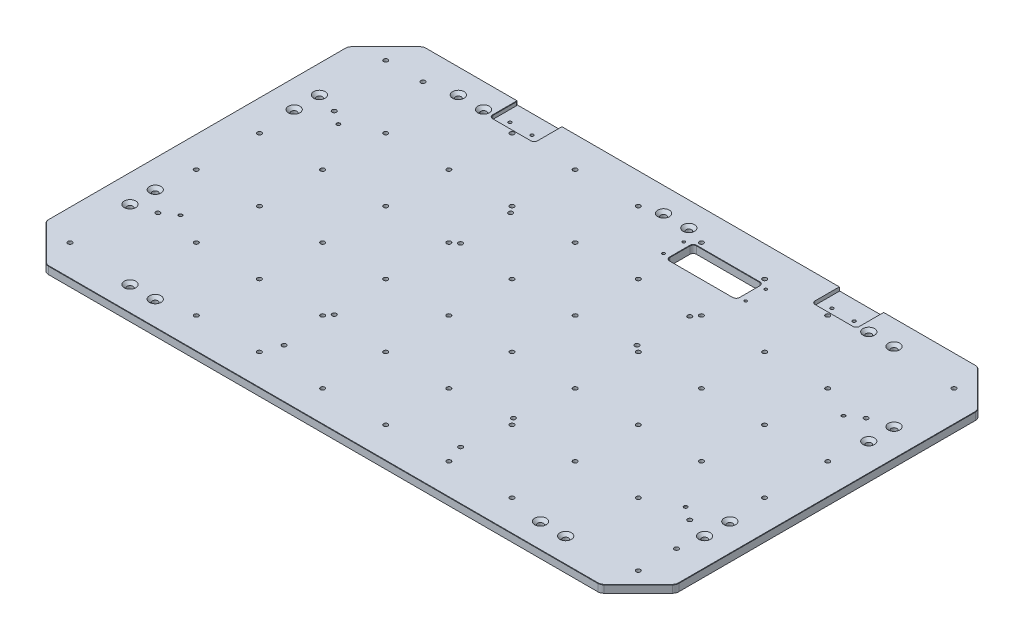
from build123d import *

# Parameters (mm, degrees)
AUFSATZ_LINEAR_AUSTRAGEN1_DEPTH                      = 12
VERRUNDUNG1_R                                        = 10
M8_GEWINDEBOHRUNG1_D                                 = 6.8
M8_GEWINDEBOHRUNG2_D                                 = 6.8
M8_GEWINDEBOHRUNG3_D                                 = 6.8
LINEARES_MUSTER1_COUNT                               = 10
LINEARES_MUSTER1_PITCH                               = 100
LINEARES_MUSTER1_COUNT_DIR2                          = 6
LINEARES_MUSTER1_PITCH_DIR2                          = 100
SCHNITT_LINEAR_AUSTRAGEN1_DEPTH                      = 582.847058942
M5_GEWINDEBOHRUNG1_D                                 = 4.2
M5_GEWINDEBOHRUNG1_DEPTH                             = 12
M5_GEWINDEBOHRUNG1_TIP                               = 1.2618073
SCHNITT_LINEAR_AUSTRAGEN2_DEPTH                      = 6
VERRUNDUNG2_R                                        = 2
M6_GEWINDEBOHRUNG1_D                                 = 5
F_5_0MM_STIFTLOCH1_D                                 = 5
F_5_0MM_STIFTLOCH1_DEPTH                             = 8
F_5_0MM_STIFTLOCH1_CSINK_D                           = 5.5
F_5_0MM_STIFTLOCH1_CSINK_ANGLE                       = 90
F_5_0MM_STIFTLOCH1_TIP                               = 1.502151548
FASE1_SIZE                                           = 0.5
FASE2_SIZE                                           = 0.5
SKIZZE22_R                                           = 5
AUFSATZ_LINEAR_AUSTRAGEN2_DEPTH                      = 12
FORMSENKUNG_F_R_M8_SENKSCHRAUBE_MIT_INNE_D           = 9
FORMSENKUNG_F_R_M8_SENKSCHRAUBE_MIT_INNE_CSINK_D     = 18.25
FORMSENKUNG_F_R_M8_SENKSCHRAUBE_MIT_INNE_CSINK_ANGLE = 90
M8_GEWINDEBOHRUNG4_D                                 = 6.8


with BuildPart() as part:
    # Skizze1 → Aufsatz-Linear austragen1 (new body)
    with BuildSketch(Plane(origin=(0, 0, 0), x_dir=(1, 0, 0), z_dir=(0, 1, 0))):
        Polygon((-439, 299), (-499, 239), (-499, -239), (-439, -299), (439, -299), (499, -239), (499, 239), (439, 299), align=None)
    extrude(amount=AUFSATZ_LINEAR_AUSTRAGEN1_DEPTH)

    # Verrundung1
    verrundung1_edges = [part.edges().sort_by_distance(p)[0] for p in [
        (499, 6, -239),
        (499, 6, 239),
        (439, 6, 299),
        (-439, 6, 299),
        (-499, 6, 239),
        (-499, 6, -239),
        (-439, 6, -299),
        (439, 6, -299),
    ]]
    fillet(verrundung1_edges, radius=VERRUNDUNG1_R)

    # M8 Gewindebohrung1 (through all)
    with Locations(Plane(origin=(0, 12, 0), x_dir=(1, 0, 0), z_dir=(0, 1, 0))):
        with Locations((139.653589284, -221.153589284), (-139.653589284, -221.153589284), (139.653589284, 58.153589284), (-139.653589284, 58.153589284)):
            Hole(M8_GEWINDEBOHRUNG1_D / 2)

    # M8 Gewindebohrung2 (through all)
    with Locations(Plane(origin=(0, 12, 0), x_dir=(1, 0, 0), z_dir=(0, 1, 0))):
        with Locations((421.153589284, -139.653589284), (421.153589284, 139.653589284), (141.846410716, -139.653589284), (141.846410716, 139.653589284)):
            m8_gewindebohrung2 = Hole(M8_GEWINDEBOHRUNG2_D / 2)

    # M8 Gewindebohrung3 (through all)
    with Locations(Plane(origin=(0, 12, 0), x_dir=(1, 0, 0), z_dir=(0, 1, 0))):
        with Locations((-450, -250)):
            m8_gewindebohrung3 = Hole(M8_GEWINDEBOHRUNG3_D / 2)

    # Lineares Muster1: M8 Gewindebohrung3 10 × 6
    with Locations(*[(i * LINEARES_MUSTER1_PITCH, 0, -j * LINEARES_MUSTER1_PITCH_DIR2) for i in range(LINEARES_MUSTER1_COUNT) for j in range(LINEARES_MUSTER1_COUNT_DIR2) if (i, j) != (0, 0)]):
        add(m8_gewindebohrung3, mode=Mode.SUBTRACT)

    # Skizze8 → Schnitt-Linear austragen1 (cut, through all)
    with BuildSketch(Plane(origin=(0, 12, 0), x_dir=(1, 0, 0), z_dir=(0, 1, 0))):
        with BuildLine():
            Line((50, 200), (150, 200))
            ThreePointArc((150, 200), (153.535533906, 201.464466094), (155, 205))
            Line((155, 205), (155, 237))
            ThreePointArc((155, 237), (153.535533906, 240.535533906), (150, 242))
            Line((150, 242), (50, 242))
            ThreePointArc((50, 242), (46.464466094, 240.535533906), (45, 237))
            Line((45, 237), (45, 205))
            ThreePointArc((45, 205), (46.464466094, 201.464466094), (50, 200))
        make_face()
    extrude(amount=-SCHNITT_LINEAR_AUSTRAGEN1_DEPTH, mode=Mode.SUBTRACT)

    # M5 Gewindebohrung1
    with Locations(Plane(origin=(0, 12, 0), x_dir=(1, 0, 0), z_dir=(0, 1, 0))):
        with Locations((165, 237), (35, 237), (35, 205), (165, 205)):
            Hole(M5_GEWINDEBOHRUNG1_D / 2, depth=M5_GEWINDEBOHRUNG1_DEPTH)
            with Locations((0, 0, -(M5_GEWINDEBOHRUNG1_DEPTH + M5_GEWINDEBOHRUNG1_TIP / 2))):  # 118° drill point
                Cone(0, M5_GEWINDEBOHRUNG1_D / 2, M5_GEWINDEBOHRUNG1_TIP, mode=Mode.SUBTRACT)

    # Skizze11 → Schnitt-Linear austragen2 (cut)
    with BuildSketch(Plane(origin=(0, 12, 0), x_dir=(1, 0, 0), z_dir=(0, 1, 0))):
        with BuildLine():
            Line((-290.1, 299), (-219.9, 299))
            Line((-219.9, 299), (-219.9, 260))
            ThreePointArc((-219.9, 260), (-221.364466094, 256.464466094), (-224.9, 255))
            Line((-224.9, 255), (-285.1, 255))
            ThreePointArc((-285.1, 255), (-288.635533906, 256.464466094), (-290.1, 260))
            Line((-290.1, 260), (-290.1, 299))
        make_face()
        with BuildLine():
            Line((219.9, 299), (219.9, 260))
            ThreePointArc((219.9, 260), (221.364466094, 256.464466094), (224.9, 255))
            Line((224.9, 255), (285.1, 255))
            ThreePointArc((285.1, 255), (288.635533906, 256.464466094), (290.1, 260))
            Line((290.1, 260), (290.1, 299))
            Line((290.1, 299), (219.9, 299))
        make_face()
    extrude(amount=-SCHNITT_LINEAR_AUSTRAGEN2_DEPTH, mode=Mode.SUBTRACT)

    # Verrundung2
    verrundung2_edges = [part.edges().sort_by_distance(p)[0] for p in [
        (-290.1, 9, -299),
        (-219.9, 9, -299),
    ]]
    fillet(verrundung2_edges, radius=VERRUNDUNG2_R)

    # M6 Gewindebohrung1 (through all)
    with Locations(Plane(origin=(0, 6, 0), x_dir=(1, 0, 0), z_dir=(0, 1, 0))):
        with Locations((-272.5, 269.2), (-237.5, 269.2), (237.5, 269.2), (272.5, 269.2)):
            Hole(M6_GEWINDEBOHRUNG1_D / 2)

    # Spiegeln1: M8 Gewindebohrung2 across plane
    add(m8_gewindebohrung2.mirror(Plane(origin=(0, 0, 0), x_dir=(0, 0, 1), z_dir=(1, 0, 0))), mode=Mode.SUBTRACT)

    # 5.0mm Stiftloch1
    with Locations(Plane(origin=(0, 12, 0), x_dir=(1, 0, 0), z_dir=(0, 1, 0))):
        with Locations((-400, -125), (400, 125), (400, -125), (-400, 125)):
            CounterSinkHole(F_5_0MM_STIFTLOCH1_D / 2, F_5_0MM_STIFTLOCH1_CSINK_D / 2, depth=F_5_0MM_STIFTLOCH1_DEPTH, counter_sink_angle=F_5_0MM_STIFTLOCH1_CSINK_ANGLE)
            with Locations((0, 0, -(F_5_0MM_STIFTLOCH1_DEPTH + F_5_0MM_STIFTLOCH1_TIP / 2))):  # 118° drill point
                Cone(0, F_5_0MM_STIFTLOCH1_D / 2, F_5_0MM_STIFTLOCH1_TIP, mode=Mode.SUBTRACT)

    # Fase1
    fase1_edges = [part.edges().sort_by_distance(p)[0] for p in [
        (499, 12, 0),
        (469, 12, 269),
        (469, 12, -269),
        (362.478932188, 12, -299),
        (-469, 12, -269),
        (-499, 12, 0),
        (-469, 12, 269),
        (0, 12, 299),
        (438.6846987, 12, -298.238795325),
        (498.238795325, 12, -238.6846987),
        (-438.6846987, 12, -298.238795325),
        (-498.238795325, 12, -238.6846987),
        (-498.238795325, 12, 238.6846987),
        (-438.6846987, 12, 298.238795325),
        (438.6846987, 12, 298.238795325),
        (498.238795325, 12, 238.6846987),
        (-288.635533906, 12, -256.464466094),
        (-255, 12, -255),
        (-221.364466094, 12, -256.464466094),
        (-219.9, 12, -278.5),
        (1, 12, -299),
        (-363.478932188, 12, -299),
        (-290.1, 12, -278.5),
        (-290.685786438, 12, -298.414213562),
        (-219.314213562, 12, -298.414213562),
    ]]
    chamfer(fase1_edges, length=FASE1_SIZE)

    # Fase2
    fase2_edges = [part.edges().sort_by_distance(p)[0] for p in [
        (46.464466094, 12, -201.464466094),
        (100, 12, -200),
        (153.535533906, 12, -201.464466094),
        (155, 12, -221),
        (153.535533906, 12, -240.535533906),
        (100, 12, -242),
        (46.464466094, 12, -240.535533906),
        (45, 12, -221),
    ]]
    chamfer(fase2_edges, length=FASE2_SIZE)

    # Skizze22 → Aufsatz-Linear austragen2 (add)
    with BuildSketch(Plane(origin=(0, 12, 0), x_dir=(1, 0, 0), z_dir=(0, 1, 0))):
        with Locations((350, -250)):
            Circle(SKIZZE22_R)
        with Locations((450, -150)):
            Circle(SKIZZE22_R)
        with Locations((350, 250)):
            Circle(SKIZZE22_R)
        with Locations((450, 150)):
            Circle(SKIZZE22_R)
        with Locations((-450, 150)):
            Circle(SKIZZE22_R)
        with Locations((-350, 250)):
            Circle(SKIZZE22_R)
        with Locations((-450, -150)):
            Circle(SKIZZE22_R)
        with Locations((-350, -250)):
            Circle(SKIZZE22_R)
    extrude(amount=-AUFSATZ_LINEAR_AUSTRAGEN2_DEPTH)

    # Formsenkung f_r M8 Senkschraube mit Inne (through all)
    with Locations(Plane(origin=(0, 12, 0), x_dir=(1, 0, 0), z_dir=(0, 1, 0))):
        with Locations((345, 260), (-345, -260), (-345, 260), (345, -260), (305, 260), (305, -260), (-305, -260), (-305, 260), (-455, 150), (-455, 110), (-455, -110), (-455, -150), (455, 150), (455, 110), (455, -110), (455, -150), (-20, 260), (20, 260)):
            CounterSinkHole(FORMSENKUNG_F_R_M8_SENKSCHRAUBE_MIT_INNE_D / 2, FORMSENKUNG_F_R_M8_SENKSCHRAUBE_MIT_INNE_CSINK_D / 2, counter_sink_angle=FORMSENKUNG_F_R_M8_SENKSCHRAUBE_MIT_INNE_CSINK_ANGLE)

    # M8 Gewindebohrung4 (through all)
    with Locations(Plane(origin=(0, 12, 0), x_dir=(1, 0, 0), z_dir=(0, 1, 0))):
        with Locations((-391, 250), (450, -189.5)):
            Hole(M8_GEWINDEBOHRUNG4_D / 2)


solid = part.part
